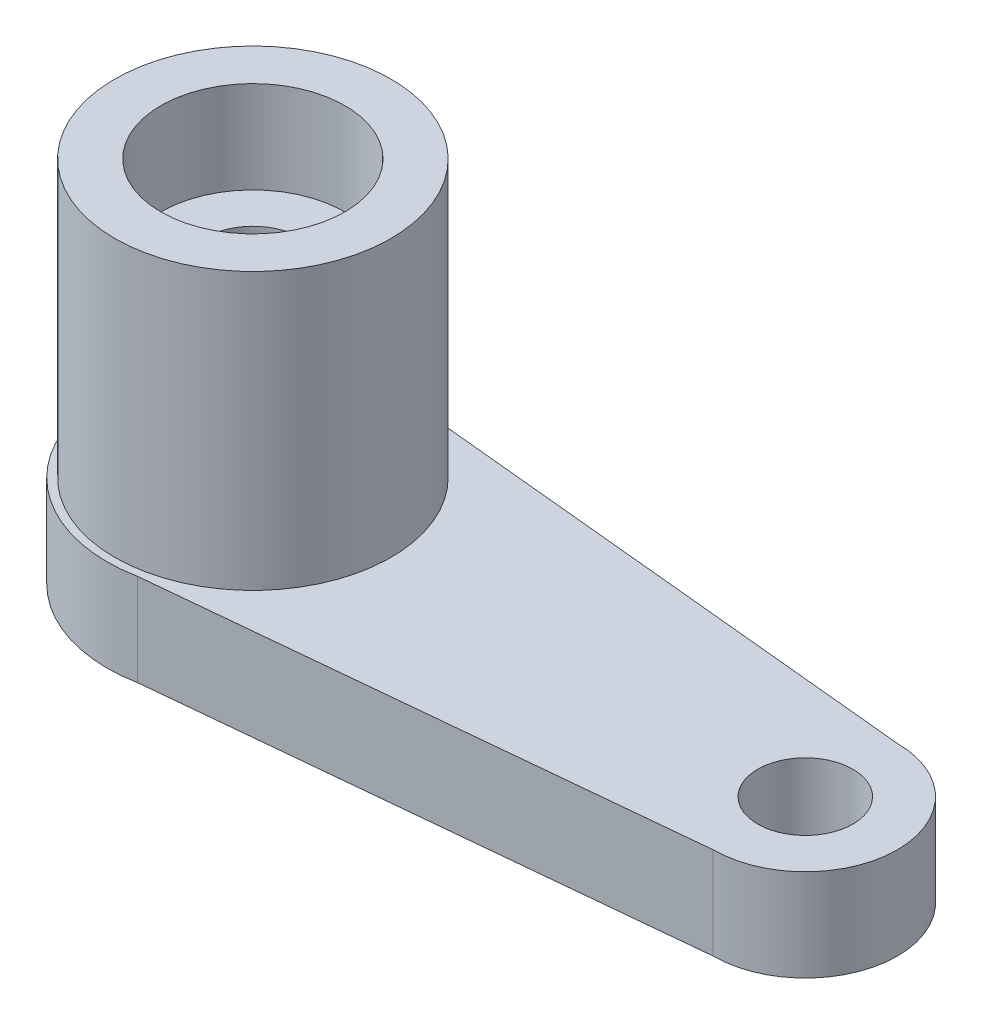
from build123d import *

# Parameters (mm, degrees)
BOSS_EXTRUDE1_DEPTH = 3
CUT_EXTRUDE1_REACH  = 23.739
SKETCH2_R           = 1.55
SKETCH3_R           = 4.5
BOSS_EXTRUDE2_DEPTH = 9
SKETCH4_R           = 3
CUT_EXTRUDE2_DEPTH  = 2.5
CUT_EXTRUDE3_START  = -3
SKETCH5_R           = 3
CUT_EXTRUDE3_DEPTH  = 3
CUT_EXTRUDE4_REACH  = 25.336
SKETCH6_R           = 1.55


with BuildPart() as part:
    # Sketch1 → Boss-Extrude1 (new body)
    with BuildSketch(Plane(origin=(0, 0, 0), x_dir=(1, 0, 0), z_dir=(0, 1, 0))):
        with BuildLine():
            Line((0.9, 4.663957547), (18, 3))
            ThreePointArc((18, 3), (21, 0), (18, -3))
            Line((18, -3), (0.9, -4.663957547))
            ThreePointArc((0.9, -4.663957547), (-4.75, 0), (0.9, 4.663957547))
        make_face()
    extrude(amount=BOSS_EXTRUDE1_DEPTH)

    # Sketch2 → Cut-Extrude1 (cut, up to next)
    with BuildSketch(Plane(origin=(0, 3, 0), x_dir=(1, 0, 0), z_dir=(0, 1, 0)), mode=Mode.PRIVATE) as cut_extrude1_sk1:
        with Locations(Location((18, 0, 0), (0, 0, 270))):
            Circle(SKETCH2_R)
    cut_extrude1_tool1 = extrude(cut_extrude1_sk1.sketch, amount=-CUT_EXTRUDE1_REACH, mode=Mode.PRIVATE) & part.part
    add(cut_extrude1_tool1.solids().sort_by_distance((18, 3, 0))[0], mode=Mode.SUBTRACT)

    # Sketch3 → Boss-Extrude2 (add)
    with BuildSketch(Plane(origin=(0, 3, 0), x_dir=(1, 0, 0), z_dir=(0, 1, 0))):
        with Locations(Location((0, 0, 0), (0, 0, 270))):
            Circle(SKETCH3_R)
    extrude(amount=BOSS_EXTRUDE2_DEPTH)

    # Sketch4 → Cut-Extrude2 (cut)
    with BuildSketch(Plane.XZ):
        with Locations(Location((0, 0, 0), (0, 0, 270))):
            Circle(SKETCH4_R)
    extrude(amount=-CUT_EXTRUDE2_DEPTH, mode=Mode.SUBTRACT)

    # Sketch5 → Cut-Extrude3 (cut)
    with BuildSketch(Plane(origin=(0, 12, 0), x_dir=(1, 0, 0), z_dir=(0, 1, 0)).offset(CUT_EXTRUDE3_START)):
        with Locations(Location((0, 0, 0), (0, 0, 90))):
            Circle(SKETCH5_R)
    extrude(amount=CUT_EXTRUDE3_DEPTH, mode=Mode.SUBTRACT)

    # Sketch6 → Cut-Extrude4 (cut, up to next)
    with BuildSketch(Plane(origin=(0, 9, 0), x_dir=(1, 0, 0), z_dir=(0, 1, 0)), mode=Mode.PRIVATE) as cut_extrude4_sk1:
        with Locations(Location((0, 0, 0), (0, 0, 270))):
            Circle(SKETCH6_R)
    cut_extrude4_tool1 = extrude(cut_extrude4_sk1.sketch, amount=-CUT_EXTRUDE4_REACH, mode=Mode.PRIVATE) & part.part
    add(cut_extrude4_tool1.solids().sort_by_distance((0, 9, 0))[0], mode=Mode.SUBTRACT)


solid = part.part
